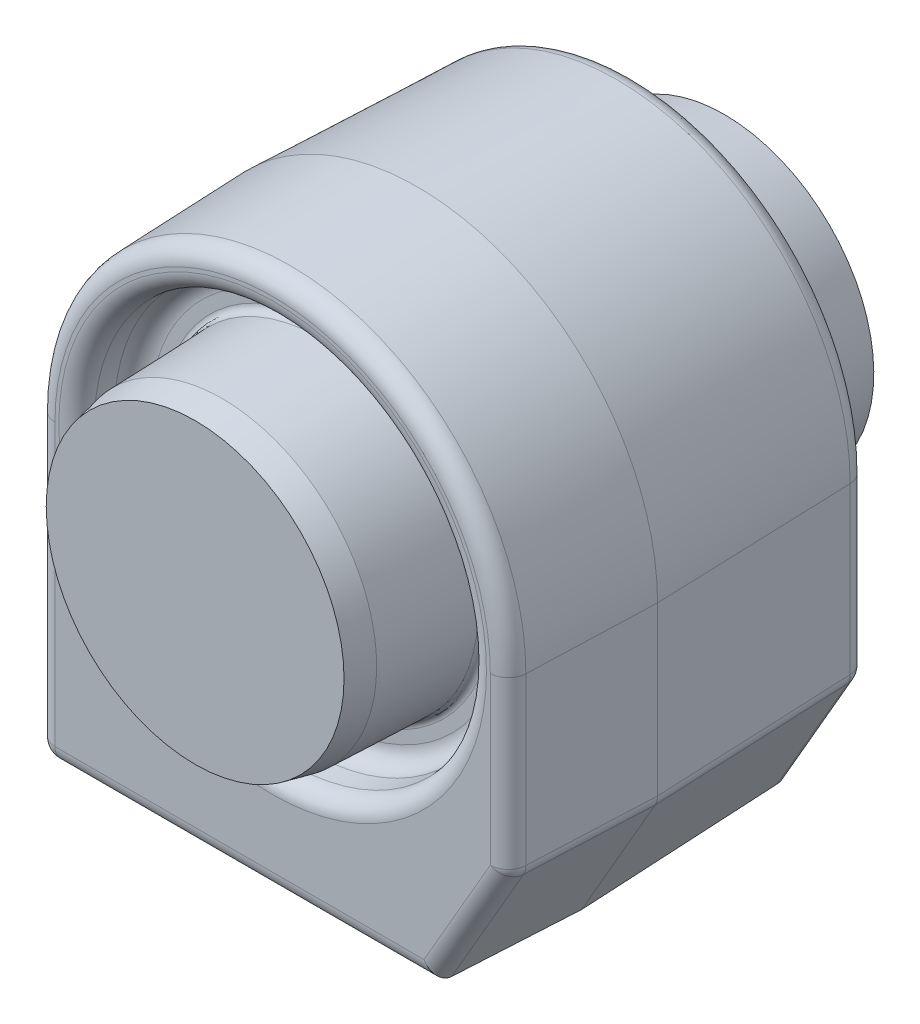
ISO-10303-21;
HEADER;
FILE_DESCRIPTION(('STEP AP214'),'2;1');
FILE_NAME('part.step','',(''),(''),'','','');
FILE_SCHEMA(('AUTOMOTIVE_DESIGN { 1 0 10303 214 1 1 1 1 }'));
ENDSEC;
DATA;
#1=APPLICATION_CONTEXT('core data for automotive mechanical design processes');
#2=APPLICATION_PROTOCOL_DEFINITION('international standard','automotive_design',2000,#1);
#3=PRODUCT_CONTEXT('',#1,'mechanical');
#4=PRODUCT('Part','Part','',(#3));
#5=PRODUCT_RELATED_PRODUCT_CATEGORY('part','',(#4));
#6=PRODUCT_DEFINITION_FORMATION('','',#4);
#7=PRODUCT_DEFINITION_CONTEXT('part definition',#1,'design');
#8=PRODUCT_DEFINITION('design','',#6,#7);
#9=PRODUCT_DEFINITION_SHAPE('','',#8);
#10=(LENGTH_UNIT() NAMED_UNIT(*) SI_UNIT(.MILLI.,.METRE.));
#11=(NAMED_UNIT(*) PLANE_ANGLE_UNIT() SI_UNIT($,.RADIAN.));
#12=(NAMED_UNIT(*) SI_UNIT($,.STERADIAN.) SOLID_ANGLE_UNIT());
#13=UNCERTAINTY_MEASURE_WITH_UNIT(LENGTH_MEASURE(1.E-05),#10,'distance_accuracy_value','');
#14=(GEOMETRIC_REPRESENTATION_CONTEXT(3) GLOBAL_UNCERTAINTY_ASSIGNED_CONTEXT((#13)) GLOBAL_UNIT_ASSIGNED_CONTEXT((#10,
#11,#12)) REPRESENTATION_CONTEXT('',''));
#15=CARTESIAN_POINT('',(0.,0.,0.));
#16=DIRECTION('',(0.,0.,1.));
#17=DIRECTION('',(1.,0.,0.));
#18=AXIS2_PLACEMENT_3D('',#15,#16,#17);
#19=CARTESIAN_POINT('',(0.,0.,109.090909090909));
#20=DIRECTION('',(0.,0.,-1.));
#21=DIRECTION('',(-1.,0.,0.));
#22=AXIS2_PLACEMENT_3D('',#19,#20,#21);
#23=PLANE('',#22);
#24=CARTESIAN_POINT('',(0.,0.,109.090909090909));
#25=DIRECTION('',(0.,0.,-1.));
#26=DIRECTION('',(-1.,0.,0.));
#27=AXIS2_PLACEMENT_3D('',#24,#25,#26);
#28=CIRCLE('',#27,86.3379751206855);
#29=CARTESIAN_POINT('',(-86.3379751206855,0.,109.090909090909));
#30=VERTEX_POINT('',#29);
#31=EDGE_CURVE('E196',#30,#30,#28,.T.);
#32=ORIENTED_EDGE('',*,*,#31,.F.);
#33=EDGE_LOOP('',(#32));
#34=FACE_BOUND('',#33,.T.);
#35=CARTESIAN_POINT('',(0.,0.,109.090909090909));
#36=DIRECTION('',(0.,0.,-1.));
#37=DIRECTION('',(-1.,0.,0.));
#38=AXIS2_PLACEMENT_3D('',#35,#36,#37);
#39=CIRCLE('',#38,86.34);
#40=CARTESIAN_POINT('',(-86.34,0.,109.090909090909));
#41=VERTEX_POINT('',#40);
#42=EDGE_CURVE('E311',#41,#41,#39,.T.);
#43=ORIENTED_EDGE('',*,*,#42,.T.);
#44=EDGE_LOOP('',(#43));
#45=FACE_BOUND('',#44,.T.);
#46=ADVANCED_FACE('F35',(#34,#45),#23,.T.);
#47=CARTESIAN_POINT('',(0.,0.,80.8080808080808));
#48=DIRECTION('',(0.,0.,-1.));
#49=DIRECTION('',(1.,0.,0.));
#50=AXIS2_PLACEMENT_3D('',#47,#48,#49);
#51=CONICAL_SURFACE('',#50,131.313131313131,0.0349065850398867);
#52=DIRECTION('',(-0.034899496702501,0.,0.999390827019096));
#53=VECTOR('',#52,1.);
#54=CARTESIAN_POINT('',(131.313131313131,0.,80.8080808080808));
#55=LINE('',#54,#53);
#56=CARTESIAN_POINT('',(134.135011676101,0.,0.));
#57=VERTEX_POINT('',#56);
#58=CARTESIAN_POINT('',(131.65355608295,0.,71.0595908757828));
#59=VERTEX_POINT('',#58);
#60=EDGE_CURVE('E167',#57,#59,#55,.T.);
#61=ORIENTED_EDGE('',*,*,#60,.F.);
#62=CARTESIAN_POINT('',(0.,0.,0.));
#63=DIRECTION('',(0.,0.,-1.));
#64=DIRECTION('',(-1.,0.,0.));
#65=AXIS2_PLACEMENT_3D('',#62,#63,#64);
#66=CIRCLE('',#65,134.135011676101);
#67=CARTESIAN_POINT('',(-134.135011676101,0.,0.));
#68=VERTEX_POINT('',#67);
#69=EDGE_CURVE('E182',#57,#68,#66,.F.);
#70=ORIENTED_EDGE('',*,*,#69,.T.);
#71=DIRECTION('',(0.034899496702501,0.,0.999390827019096));
#72=VECTOR('',#71,1.);
#73=CARTESIAN_POINT('',(-131.313131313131,0.,80.8080808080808));
#74=LINE('',#73,#72);
#75=CARTESIAN_POINT('',(-131.65355608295,0.,71.0595908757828));
#76=VERTEX_POINT('',#75);
#77=EDGE_CURVE('E166',#68,#76,#74,.T.);
#78=ORIENTED_EDGE('',*,*,#77,.T.);
#79=CARTESIAN_POINT('',(0.,0.,71.0595908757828));
#80=DIRECTION('',(0.,0.,-1.));
#81=DIRECTION('',(-1.,0.,0.));
#82=AXIS2_PLACEMENT_3D('',#79,#80,#81);
#83=CIRCLE('',#82,131.65355608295);
#84=EDGE_CURVE('E194',#59,#76,#83,.F.);
#85=ORIENTED_EDGE('',*,*,#84,.F.);
#86=EDGE_LOOP('',(#61,#70,#78,#85));
#87=FACE_BOUND('',#86,.T.);
#88=ADVANCED_FACE('F193',(#87),#51,.T.);
#89=CARTESIAN_POINT('',(-131.313131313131,-156.565656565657,80.8080808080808));
#90=DIRECTION('',(0.999390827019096,0.,-0.034899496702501));
#91=DIRECTION('',(-0.034899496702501,0.,-0.999390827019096));
#92=AXIS2_PLACEMENT_3D('',#89,#90,#91);
#93=PLANE('',#92);
#94=DIRECTION('',(0.,-1.,0.));
#95=VECTOR('',#94,1.);
#96=CARTESIAN_POINT('',(-131.65355608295,-166.666666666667,71.0595908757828));
#97=LINE('',#96,#95);
#98=CARTESIAN_POINT('',(-131.65355608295,-156.912234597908,71.0595908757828));
#99=VERTEX_POINT('',#98);
#100=EDGE_CURVE('E288',#76,#99,#97,.T.);
#101=ORIENTED_EDGE('',*,*,#100,.F.);
#102=ORIENTED_EDGE('',*,*,#77,.F.);
#103=DIRECTION('',(0.,1.,0.));
#104=VECTOR('',#103,1.);
#105=CARTESIAN_POINT('',(-134.135011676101,-156.565656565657,0.));
#106=LINE('',#105,#104);
#107=CARTESIAN_POINT('',(-134.135011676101,-159.393690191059,0.));
#108=VERTEX_POINT('',#107);
#109=EDGE_CURVE('E191',#68,#108,#106,.F.);
#110=ORIENTED_EDGE('',*,*,#109,.T.);
#111=DIRECTION('',(-0.0348782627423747,-0.0348782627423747,-0.998782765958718));
#112=VECTOR('',#111,1.);
#113=CARTESIAN_POINT('',(-134.14729200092,-159.405970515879,-0.351662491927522));
#114=LINE('',#113,#112);
#115=EDGE_CURVE('E290',#99,#108,#114,.T.);
#116=ORIENTED_EDGE('',*,*,#115,.F.);
#117=EDGE_LOOP('',(#101,#102,#110,#116));
#118=FACE_BOUND('',#117,.T.);
#119=ADVANCED_FACE('F352',(#118),#93,.F.);
#120=CARTESIAN_POINT('',(90.1277750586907,-166.666666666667,80.8080808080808));
#121=DIRECTION('',(0.,0.999390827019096,-0.034899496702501));
#122=DIRECTION('',(0.,0.034899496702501,0.999390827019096));
#123=AXIS2_PLACEMENT_3D('',#120,#121,#122);
#124=PLANE('',#123);
#125=DIRECTION('',(-0.0348782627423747,-0.0348782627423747,-0.998782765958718));
#126=VECTOR('',#125,1.);
#127=CARTESIAN_POINT('',(-121.230554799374,-166.678946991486,80.4564183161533));
#128=LINE('',#127,#126);
#129=CARTESIAN_POINT('',(-124.040154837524,-169.488547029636,0.));
#130=VERTEX_POINT('',#129);
#131=CARTESIAN_POINT('',(-121.558699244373,-167.007091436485,71.0595908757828));
#132=VERTEX_POINT('',#131);
#133=EDGE_CURVE('E284',#130,#132,#128,.F.);
#134=ORIENTED_EDGE('',*,*,#133,.F.);
#135=DIRECTION('',(-1.,0.,0.));
#136=VECTOR('',#135,1.);
#137=CARTESIAN_POINT('',(90.1277750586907,-169.488547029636,0.));
#138=LINE('',#137,#136);
#139=CARTESIAN_POINT('',(91.7569884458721,-169.488547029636,0.));
#140=VERTEX_POINT('',#139);
#141=EDGE_CURVE('E208',#130,#140,#138,.F.);
#142=ORIENTED_EDGE('',*,*,#141,.T.);
#143=DIRECTION('',(-0.0201451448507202,0.0348924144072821,0.999188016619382));
#144=VECTOR('',#143,1.);
#145=CARTESIAN_POINT('',(90.1277750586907,-166.666666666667,80.8080808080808));
#146=LINE('',#145,#144);
#147=CARTESIAN_POINT('',(90.3243193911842,-167.007091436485,71.0595908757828));
#148=VERTEX_POINT('',#147);
#149=EDGE_CURVE('E202',#140,#148,#146,.T.);
#150=ORIENTED_EDGE('',*,*,#149,.T.);
#151=DIRECTION('',(1.,0.,0.));
#152=VECTOR('',#151,1.);
#153=CARTESIAN_POINT('',(90.1277750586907,-167.007091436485,71.0595908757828));
#154=LINE('',#153,#152);
#155=EDGE_CURVE('E286',#132,#148,#154,.T.);
#156=ORIENTED_EDGE('',*,*,#155,.F.);
#157=EDGE_LOOP('',(#134,#142,#150,#156));
#158=FACE_BOUND('',#157,.T.);
#159=ADVANCED_FACE('F362',(#158),#124,.F.);
#160=CARTESIAN_POINT('',(100.333461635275,-148.989898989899,80.8080808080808));
#161=DIRECTION('',(-0.865497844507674,0.499695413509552,-0.034899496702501));
#162=DIRECTION('',(-0.500000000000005,-0.866025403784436,0.));
#163=AXIS2_PLACEMENT_3D('',#160,#161,#162);
#164=PLANE('',#163);
#165=DIRECTION('',(0.500000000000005,0.866025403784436,0.));
#166=VECTOR('',#165,1.);
#167=CARTESIAN_POINT('',(131.607947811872,-95.5017494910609,71.0595908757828));
#168=LINE('',#167,#166);
#169=CARTESIAN_POINT('',(130.301101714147,-97.7652733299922,71.0595908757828));
#170=VERTEX_POINT('',#169);
#171=EDGE_CURVE('E271',#148,#170,#168,.T.);
#172=ORIENTED_EDGE('',*,*,#171,.F.);
#173=ORIENTED_EDGE('',*,*,#149,.F.);
#174=DIRECTION('',(-0.500000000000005,-0.866025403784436,0.));
#175=VECTOR('',#174,1.);
#176=CARTESIAN_POINT('',(102.777281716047,-150.400839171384,0.));
#177=LINE('',#176,#175);
#178=CARTESIAN_POINT('',(132.782557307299,-98.4301773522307,0.));
#179=VERTEX_POINT('',#178);
#180=EDGE_CURVE('E178',#140,#179,#177,.F.);
#181=ORIENTED_EDGE('',*,*,#180,.T.);
#182=DIRECTION('',(0.0348979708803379,-0.00935088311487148,-0.999347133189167));
#183=VECTOR('',#182,1.);
#184=CARTESIAN_POINT('',(132.783439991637,-98.4304138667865,-0.0252767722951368));
#185=LINE('',#184,#183);
#186=EDGE_CURVE('E273',#170,#179,#185,.T.);
#187=ORIENTED_EDGE('',*,*,#186,.F.);
#188=EDGE_LOOP('',(#172,#173,#181,#187));
#189=FACE_BOUND('',#188,.T.);
#190=ADVANCED_FACE('F366',(#189),#164,.F.);
#191=CARTESIAN_POINT('',(131.313131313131,0.,80.8080808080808));
#192=DIRECTION('',(-0.999390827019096,0.,-0.034899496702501));
#193=DIRECTION('',(-0.034899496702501,0.,0.999390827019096));
#194=AXIS2_PLACEMENT_3D('',#191,#192,#193);
#195=PLANE('',#194);
#196=DIRECTION('',(0.0348979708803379,-0.00935088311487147,-0.999347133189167));
#197=VECTOR('',#196,1.);
#198=CARTESIAN_POINT('',(131.31401399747,-92.6268648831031,80.7828040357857));
#199=LINE('',#198,#197);
#200=CARTESIAN_POINT('',(134.135011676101,-93.3827489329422,0.));
#201=VERTEX_POINT('',#200);
#202=CARTESIAN_POINT('',(131.65355608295,-92.7178449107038,71.0595908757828));
#203=VERTEX_POINT('',#202);
#204=EDGE_CURVE('E175',#201,#203,#199,.F.);
#205=ORIENTED_EDGE('',*,*,#204,.F.);
#206=DIRECTION('',(0.,-1.,0.));
#207=VECTOR('',#206,1.);
#208=CARTESIAN_POINT('',(134.135011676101,0.,0.));
#209=LINE('',#208,#207);
#210=EDGE_CURVE('E158',#201,#57,#209,.F.);
#211=ORIENTED_EDGE('',*,*,#210,.T.);
#212=ORIENTED_EDGE('',*,*,#60,.T.);
#213=DIRECTION('',(0.,1.,0.));
#214=VECTOR('',#213,1.);
#215=CARTESIAN_POINT('',(131.65355608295,0.,71.0595908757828));
#216=LINE('',#215,#214);
#217=EDGE_CURVE('E258',#203,#59,#216,.T.);
#218=ORIENTED_EDGE('',*,*,#217,.F.);
#219=EDGE_LOOP('',(#205,#211,#212,#218));
#220=FACE_BOUND('',#219,.T.);
#221=ADVANCED_FACE('F171',(#220),#195,.F.);
#222=CARTESIAN_POINT('',(0.,0.,-90.9090909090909));
#223=DIRECTION('',(0.,0.,1.));
#224=DIRECTION('',(1.,0.,0.));
#225=AXIS2_PLACEMENT_3D('',#222,#223,#224);
#226=CONICAL_SURFACE('',#225,88.3838383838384,0.0349065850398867);
#227=CARTESIAN_POINT('',(0.,0.,-94.8084868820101));
#228=DIRECTION('',(0.,0.,1.));
#229=DIRECTION('',(1.,0.,0.));
#230=AXIS2_PLACEMENT_3D('',#227,#228,#229);
#231=CIRCLE('',#230,88.247668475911);
#232=CARTESIAN_POINT('',(88.247668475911,0.,-94.8084868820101));
#233=VERTEX_POINT('',#232);
#234=EDGE_CURVE('E299',#233,#233,#231,.T.);
#235=ORIENTED_EDGE('',*,*,#234,.F.);
#236=EDGE_LOOP('',(#235));
#237=FACE_BOUND('',#236,.T.);
#238=CARTESIAN_POINT('',(0.,0.,-141.414141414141));
#239=DIRECTION('',(0.,0.,1.));
#240=DIRECTION('',(1.,0.,0.));
#241=AXIS2_PLACEMENT_3D('',#238,#239,#240);
#242=CIRCLE('',#241,86.6201631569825);
#243=CARTESIAN_POINT('',(86.6201631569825,0.,-141.414141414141));
#244=VERTEX_POINT('',#243);
#245=EDGE_CURVE('E199',#244,#244,#242,.T.);
#246=ORIENTED_EDGE('',*,*,#245,.T.);
#247=EDGE_LOOP('',(#246));
#248=FACE_BOUND('',#247,.T.);
#249=ADVANCED_FACE('F372',(#237,#248),#226,.T.);
#250=CARTESIAN_POINT('',(0.,0.,50.5050505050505));
#251=DIRECTION('',(0.,0.,-1.));
#252=DIRECTION('',(-1.,0.,0.));
#253=AXIS2_PLACEMENT_3D('',#250,#251,#252);
#254=CONICAL_SURFACE('',#253,88.3838383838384,0.0349065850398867);
#255=CARTESIAN_POINT('',(0.,0.,54.4044464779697));
#256=DIRECTION('',(0.,0.,-1.));
#257=DIRECTION('',(-1.,0.,0.));
#258=AXIS2_PLACEMENT_3D('',#255,#256,#257);
#259=CIRCLE('',#258,88.247668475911);
#260=CARTESIAN_POINT('',(-88.247668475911,0.,54.4044464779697));
#261=VERTEX_POINT('',#260);
#262=EDGE_CURVE('E305',#261,#261,#259,.T.);
#263=ORIENTED_EDGE('',*,*,#262,.F.);
#264=EDGE_LOOP('',(#263));
#265=FACE_BOUND('',#264,.T.);
#266=ORIENTED_EDGE('',*,*,#31,.T.);
#267=EDGE_LOOP('',(#266));
#268=FACE_BOUND('',#267,.T.);
#269=ADVANCED_FACE('F392',(#265,#268),#254,.T.);
#270=CARTESIAN_POINT('',(0.,0.,-121.212121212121));
#271=DIRECTION('',(0.,0.,1.));
#272=DIRECTION('',(1.,0.,0.));
#273=AXIS2_PLACEMENT_3D('',#270,#271,#272);
#274=PLANE('',#273);
#275=DIRECTION('',(-0.500000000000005,-0.866025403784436,0.));
#276=VECTOR('',#275,1.);
#277=CARTESIAN_POINT('',(130.095118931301,-75.110451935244,-121.212121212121));
#278=LINE('',#277,#276);
#279=CARTESIAN_POINT('',(83.6814443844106,-155.501294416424,-121.212121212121));
#280=VERTEX_POINT('',#279);
#281=CARTESIAN_POINT('',(120.147759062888,-92.3397846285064,-121.212121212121));
#282=VERTEX_POINT('',#281);
#283=EDGE_CURVE('E249',#280,#282,#278,.F.);
#284=ORIENTED_EDGE('',*,*,#283,.F.);
#285=DIRECTION('',(-1.,0.,0.));
#286=VECTOR('',#285,1.);
#287=CARTESIAN_POINT('',(0.,-155.501294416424,-121.212121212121));
#288=LINE('',#287,#286);
#289=CARTESIAN_POINT('',(-120.147759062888,-155.501294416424,-121.212121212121));
#290=VERTEX_POINT('',#289);
#291=EDGE_CURVE('E247',#290,#280,#288,.F.);
#292=ORIENTED_EDGE('',*,*,#291,.F.);
#293=DIRECTION('',(0.,1.,0.));
#294=VECTOR('',#293,1.);
#295=CARTESIAN_POINT('',(-120.147759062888,0.,-121.212121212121));
#296=LINE('',#295,#294);
#297=CARTESIAN_POINT('',(-120.147759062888,0.,-121.212121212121));
#298=VERTEX_POINT('',#297);
#299=EDGE_CURVE('E245',#298,#290,#296,.F.);
#300=ORIENTED_EDGE('',*,*,#299,.F.);
#301=CARTESIAN_POINT('',(0.,0.,-121.212121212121));
#302=DIRECTION('',(0.,0.,1.));
#303=DIRECTION('',(1.,0.,0.));
#304=AXIS2_PLACEMENT_3D('',#301,#302,#303);
#305=CIRCLE('',#304,120.147759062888);
#306=CARTESIAN_POINT('',(120.147759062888,0.,-121.212121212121));
#307=VERTEX_POINT('',#306);
#308=EDGE_CURVE('E243',#307,#298,#305,.T.);
#309=ORIENTED_EDGE('',*,*,#308,.F.);
#310=DIRECTION('',(0.,-1.,0.));
#311=VECTOR('',#310,1.);
#312=CARTESIAN_POINT('',(120.147759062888,0.,-121.212121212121));
#313=LINE('',#312,#311);
#314=EDGE_CURVE('E251',#282,#307,#313,.F.);
#315=ORIENTED_EDGE('',*,*,#314,.F.);
#316=EDGE_LOOP('',(#284,#292,#300,#309,#315));
#317=FACE_BOUND('',#316,.T.);
#318=CARTESIAN_POINT('',(0.,0.,-121.212121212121));
#319=DIRECTION('',(0.,0.,1.));
#320=DIRECTION('',(1.,0.,0.));
#321=AXIS2_PLACEMENT_3D('',#318,#319,#320);
#322=CIRCLE('',#321,119.39849579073);
#323=CARTESIAN_POINT('',(119.39849579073,0.,-121.212121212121));
#324=VERTEX_POINT('',#323);
#325=EDGE_CURVE('E237',#324,#324,#322,.F.);
#326=ORIENTED_EDGE('',*,*,#325,.F.);
#327=EDGE_LOOP('',(#326));
#328=FACE_BOUND('',#327,.T.);
#329=ADVANCED_FACE('F358',(#317,#328),#274,.F.);
#330=CARTESIAN_POINT('',(0.,0.,80.8080808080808));
#331=DIRECTION('',(0.,0.,1.));
#332=DIRECTION('',(1.,0.,0.));
#333=AXIS2_PLACEMENT_3D('',#330,#331,#332);
#334=PLANE('',#333);
#335=CARTESIAN_POINT('',(0.,0.,80.8080808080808));
#336=DIRECTION('',(0.,0.,1.));
#337=DIRECTION('',(1.,0.,0.));
#338=AXIS2_PLACEMENT_3D('',#335,#336,#337);
#339=CIRCLE('',#338,121.558699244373);
#340=CARTESIAN_POINT('',(-121.558699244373,0.,80.8080808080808));
#341=VERTEX_POINT('',#340);
#342=CARTESIAN_POINT('',(121.558699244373,0.,80.8080808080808));
#343=VERTEX_POINT('',#342);
#344=EDGE_CURVE('E260',#341,#343,#339,.F.);
#345=ORIENTED_EDGE('',*,*,#344,.F.);
#346=DIRECTION('',(0.,1.,0.));
#347=VECTOR('',#346,1.);
#348=CARTESIAN_POINT('',(-121.558699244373,0.,80.8080808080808));
#349=LINE('',#348,#347);
#350=CARTESIAN_POINT('',(-121.558699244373,-156.912234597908,80.8080808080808));
#351=VERTEX_POINT('',#350);
#352=EDGE_CURVE('E262',#351,#341,#349,.T.);
#353=ORIENTED_EDGE('',*,*,#352,.F.);
#354=DIRECTION('',(-1.,0.,0.));
#355=VECTOR('',#354,1.);
#356=CARTESIAN_POINT('',(-131.313131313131,-156.912234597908,80.8080808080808));
#357=LINE('',#356,#355);
#358=CARTESIAN_POINT('',(84.4960510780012,-156.912234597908,80.8080808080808));
#359=VERTEX_POINT('',#358);
#360=EDGE_CURVE('E264',#359,#351,#357,.T.);
#361=ORIENTED_EDGE('',*,*,#360,.F.);
#362=DIRECTION('',(-0.500000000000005,-0.866025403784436,0.));
#363=VECTOR('',#362,1.);
#364=CARTESIAN_POINT('',(81.6801890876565,-161.789450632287,80.8080808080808));
#365=LINE('',#364,#363);
#366=CARTESIAN_POINT('',(121.558699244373,-92.7178449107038,80.8080808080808));
#367=VERTEX_POINT('',#366);
#368=EDGE_CURVE('E266',#367,#359,#365,.T.);
#369=ORIENTED_EDGE('',*,*,#368,.F.);
#370=DIRECTION('',(0.,-1.,0.));
#371=VECTOR('',#370,1.);
#372=CARTESIAN_POINT('',(121.558699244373,-95.3315371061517,80.8080808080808));
#373=LINE('',#372,#371);
#374=EDGE_CURVE('E268',#343,#367,#373,.T.);
#375=ORIENTED_EDGE('',*,*,#374,.F.);
#376=EDGE_LOOP('',(#345,#353,#361,#369,#375));
#377=FACE_BOUND('',#376,.T.);
#378=CARTESIAN_POINT('',(0.,0.,80.8080808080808));
#379=DIRECTION('',(0.,0.,1.));
#380=DIRECTION('',(1.,0.,0.));
#381=AXIS2_PLACEMENT_3D('',#378,#379,#380);
#382=CIRCLE('',#381,119.39849579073);
#383=CARTESIAN_POINT('',(119.39849579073,0.,80.8080808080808));
#384=VERTEX_POINT('',#383);
#385=EDGE_CURVE('E225',#384,#384,#382,.T.);
#386=ORIENTED_EDGE('',*,*,#385,.F.);
#387=EDGE_LOOP('',(#386));
#388=FACE_BOUND('',#387,.T.);
#389=ADVANCED_FACE('F390',(#377,#388),#334,.T.);
#390=CARTESIAN_POINT('',(90.1277750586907,-169.488547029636,0.));
#391=DIRECTION('',(0.,0.999390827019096,0.034899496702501));
#392=DIRECTION('',(0.,-0.0348994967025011,0.999390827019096));
#393=AXIS2_PLACEMENT_3D('',#390,#391,#392);
#394=PLANE('',#393);
#395=DIRECTION('',(0.0201451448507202,-0.0348924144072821,0.999188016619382));
#396=VECTOR('',#395,1.);
#397=CARTESIAN_POINT('',(91.7563272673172,-169.487401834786,-0.0327940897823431));
#398=LINE('',#397,#396);
#399=CARTESIAN_POINT('',(89.5097126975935,-165.596151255,-111.463631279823));
#400=VERTEX_POINT('',#399);
#401=EDGE_CURVE('E179',#400,#140,#398,.T.);
#402=ORIENTED_EDGE('',*,*,#401,.T.);
#403=ORIENTED_EDGE('',*,*,#141,.F.);
#404=DIRECTION('',(0.0348782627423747,0.0348782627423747,-0.998782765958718));
#405=VECTOR('',#404,1.);
#406=CARTESIAN_POINT('',(-124.052435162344,-169.500827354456,0.351662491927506));
#407=LINE('',#406,#405);
#408=CARTESIAN_POINT('',(-120.147759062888,-165.596151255,-111.463631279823));
#409=VERTEX_POINT('',#408);
#410=EDGE_CURVE('E280',#409,#130,#407,.F.);
#411=ORIENTED_EDGE('',*,*,#410,.F.);
#412=DIRECTION('',(1.,0.,0.));
#413=VECTOR('',#412,1.);
#414=CARTESIAN_POINT('',(90.1277750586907,-165.596151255,-111.463631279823));
#415=LINE('',#414,#413);
#416=EDGE_CURVE('E282',#400,#409,#415,.F.);
#417=ORIENTED_EDGE('',*,*,#416,.F.);
#418=EDGE_LOOP('',(#402,#403,#411,#417));
#419=FACE_BOUND('',#418,.T.);
#420=ADVANCED_FACE('F377',(#419),#394,.F.);
#421=CARTESIAN_POINT('',(-134.135011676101,-156.565656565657,0.));
#422=DIRECTION('',(0.999390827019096,0.,0.034899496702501));
#423=DIRECTION('',(0.0348994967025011,0.,-0.999390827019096));
#424=AXIS2_PLACEMENT_3D('',#421,#422,#423);
#425=PLANE('',#424);
#426=ORIENTED_EDGE('',*,*,#109,.F.);
#427=DIRECTION('',(0.034899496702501,0.,-0.999390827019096));
#428=VECTOR('',#427,1.);
#429=CARTESIAN_POINT('',(-134.135011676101,0.,0.));
#430=LINE('',#429,#428);
#431=CARTESIAN_POINT('',(-130.242615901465,0.,-111.463631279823));
#432=VERTEX_POINT('',#431);
#433=EDGE_CURVE('E185',#432,#68,#430,.F.);
#434=ORIENTED_EDGE('',*,*,#433,.F.);
#435=DIRECTION('',(0.,-1.,0.));
#436=VECTOR('',#435,1.);
#437=CARTESIAN_POINT('',(-130.242615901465,-156.565656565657,-111.463631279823));
#438=LINE('',#437,#436);
#439=CARTESIAN_POINT('',(-130.242615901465,-155.501294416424,-111.463631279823));
#440=VERTEX_POINT('',#439);
#441=EDGE_CURVE('E292',#440,#432,#438,.F.);
#442=ORIENTED_EDGE('',*,*,#441,.F.);
#443=DIRECTION('',(0.0348782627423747,0.0348782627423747,-0.998782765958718));
#444=VECTOR('',#443,1.);
#445=CARTESIAN_POINT('',(-129.914471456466,-155.173149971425,-120.860458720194));
#446=LINE('',#445,#444);
#447=EDGE_CURVE('E294',#108,#440,#446,.T.);
#448=ORIENTED_EDGE('',*,*,#447,.F.);
#449=EDGE_LOOP('',(#426,#434,#442,#448));
#450=FACE_BOUND('',#449,.T.);
#451=ADVANCED_FACE('F374',(#450),#425,.F.);
#452=CARTESIAN_POINT('',(0.,0.,0.));
#453=DIRECTION('',(0.,0.,1.));
#454=DIRECTION('',(-1.,0.,0.));
#455=AXIS2_PLACEMENT_3D('',#452,#453,#454);
#456=CONICAL_SURFACE('',#455,134.135011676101,0.0349065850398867);
#457=ORIENTED_EDGE('',*,*,#433,.T.);
#458=ORIENTED_EDGE('',*,*,#69,.F.);
#459=DIRECTION('',(-0.034899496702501,0.,-0.999390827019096));
#460=VECTOR('',#459,1.);
#461=CARTESIAN_POINT('',(134.135011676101,0.,0.));
#462=LINE('',#461,#460);
#463=CARTESIAN_POINT('',(130.242615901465,0.,-111.463631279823));
#464=VERTEX_POINT('',#463);
#465=EDGE_CURVE('E154',#464,#57,#462,.F.);
#466=ORIENTED_EDGE('',*,*,#465,.F.);
#467=CARTESIAN_POINT('',(0.,0.,-111.463631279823));
#468=DIRECTION('',(0.,0.,-1.));
#469=DIRECTION('',(-1.,0.,0.));
#470=AXIS2_PLACEMENT_3D('',#467,#468,#469);
#471=CIRCLE('',#470,130.242615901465);
#472=EDGE_CURVE('E296',#432,#464,#471,.T.);
#473=ORIENTED_EDGE('',*,*,#472,.F.);
#474=EDGE_LOOP('',(#457,#458,#466,#473));
#475=FACE_BOUND('',#474,.T.);
#476=ADVANCED_FACE('F183',(#475),#456,.T.);
#477=CARTESIAN_POINT('',(134.135011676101,0.,0.));
#478=DIRECTION('',(-0.999390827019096,0.,0.034899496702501));
#479=DIRECTION('',(0.0348994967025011,0.,0.999390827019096));
#480=AXIS2_PLACEMENT_3D('',#477,#478,#479);
#481=PLANE('',#480);
#482=ORIENTED_EDGE('',*,*,#465,.T.);
#483=ORIENTED_EDGE('',*,*,#210,.F.);
#484=DIRECTION('',(-0.0348979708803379,0.00935088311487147,-0.999347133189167));
#485=VECTOR('',#484,1.);
#486=CARTESIAN_POINT('',(134.13589436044,-93.3829854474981,0.0252767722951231));
#487=LINE('',#486,#485);
#488=CARTESIAN_POINT('',(130.242615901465,-92.3397846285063,-111.463631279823));
#489=VERTEX_POINT('',#488);
#490=EDGE_CURVE('E254',#489,#201,#487,.F.);
#491=ORIENTED_EDGE('',*,*,#490,.F.);
#492=DIRECTION('',(0.,1.,0.));
#493=VECTOR('',#492,1.);
#494=CARTESIAN_POINT('',(130.242615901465,0.,-111.463631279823));
#495=LINE('',#494,#493);
#496=EDGE_CURVE('E161',#464,#489,#495,.F.);
#497=ORIENTED_EDGE('',*,*,#496,.F.);
#498=EDGE_LOOP('',(#482,#483,#491,#497));
#499=FACE_BOUND('',#498,.T.);
#500=ADVANCED_FACE('F156',(#499),#481,.F.);
#501=CARTESIAN_POINT('',(102.777281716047,-150.400839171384,0.));
#502=DIRECTION('',(-0.865497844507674,0.499695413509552,0.034899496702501));
#503=DIRECTION('',(-0.500000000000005,-0.866025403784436,0.));
#504=AXIS2_PLACEMENT_3D('',#501,#502,#503);
#505=PLANE('',#504);
#506=ORIENTED_EDGE('',*,*,#180,.F.);
#507=ORIENTED_EDGE('',*,*,#401,.F.);
#508=DIRECTION('',(0.500000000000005,0.866025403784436,0.));
#509=VECTOR('',#508,1.);
#510=CARTESIAN_POINT('',(99.4063680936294,-148.454641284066,-111.463631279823));
#511=LINE('',#510,#509);
#512=CARTESIAN_POINT('',(128.890161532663,-97.3872130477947,-111.463631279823));
#513=VERTEX_POINT('',#512);
#514=EDGE_CURVE('E276',#513,#400,#511,.F.);
#515=ORIENTED_EDGE('',*,*,#514,.F.);
#516=DIRECTION('',(-0.0348979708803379,0.00935088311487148,-0.999347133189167));
#517=VECTOR('',#516,1.);
#518=CARTESIAN_POINT('',(128.550619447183,-97.2962330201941,-121.186844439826));
#519=LINE('',#518,#517);
#520=EDGE_CURVE('E278',#179,#513,#519,.T.);
#521=ORIENTED_EDGE('',*,*,#520,.F.);
#522=EDGE_LOOP('',(#506,#507,#515,#521));
#523=FACE_BOUND('',#522,.T.);
#524=ADVANCED_FACE('F383',(#523),#505,.F.);
#525=CARTESIAN_POINT('',(0.,0.,50.5050505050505));
#526=DIRECTION('',(0.,0.,1.));
#527=DIRECTION('',(-1.,0.,0.));
#528=AXIS2_PLACEMENT_3D('',#525,#526,#527);
#529=CONICAL_SURFACE('',#528,108.585858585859,0.0349065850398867);
#530=CARTESIAN_POINT('',(0.,0.,71.0595908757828));
#531=DIRECTION('',(0.,0.,1.));
#532=DIRECTION('',(1.,0.,0.));
#533=AXIS2_PLACEMENT_3D('',#530,#531,#532);
#534=CIRCLE('',#533,109.303638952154);
#535=CARTESIAN_POINT('',(109.303638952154,0.,71.0595908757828));
#536=VERTEX_POINT('',#535);
#537=EDGE_CURVE('E222',#536,#536,#534,.F.);
#538=ORIENTED_EDGE('',*,*,#537,.F.);
#539=EDGE_LOOP('',(#538));
#540=FACE_BOUND('',#539,.T.);
#541=CARTESIAN_POINT('',(0.,0.,60.2535404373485));
#542=DIRECTION('',(0.,0.,1.));
#543=DIRECTION('',(1.,0.,0.));
#544=AXIS2_PLACEMENT_3D('',#541,#542,#543);
#545=CIRCLE('',#544,108.926283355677);
#546=CARTESIAN_POINT('',(108.926283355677,0.,60.2535404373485));
#547=VERTEX_POINT('',#546);
#548=EDGE_CURVE('E190',#547,#547,#545,.T.);
#549=ORIENTED_EDGE('',*,*,#548,.F.);
#550=EDGE_LOOP('',(#549));
#551=FACE_BOUND('',#550,.T.);
#552=ADVANCED_FACE('F386',(#540,#551),#529,.F.);
#553=CARTESIAN_POINT('',(0.,0.,50.5050505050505));
#554=DIRECTION('',(0.,0.,-1.));
#555=DIRECTION('',(-1.,0.,0.));
#556=AXIS2_PLACEMENT_3D('',#553,#554,#555);
#557=PLANE('',#556);
#558=CARTESIAN_POINT('',(0.,0.,50.5050505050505));
#559=DIRECTION('',(0.,0.,-1.));
#560=DIRECTION('',(-1.,0.,0.));
#561=AXIS2_PLACEMENT_3D('',#558,#559,#560);
#562=CIRCLE('',#561,92.2856112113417);
#563=CARTESIAN_POINT('',(-92.2856112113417,0.,50.5050505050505));
#564=VERTEX_POINT('',#563);
#565=EDGE_CURVE('E308',#564,#564,#562,.F.);
#566=ORIENTED_EDGE('',*,*,#565,.F.);
#567=EDGE_LOOP('',(#566));
#568=FACE_BOUND('',#567,.T.);
#569=CARTESIAN_POINT('',(0.,0.,50.5050505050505));
#570=DIRECTION('',(0.,0.,-1.));
#571=DIRECTION('',(-1.,0.,0.));
#572=AXIS2_PLACEMENT_3D('',#569,#570,#571);
#573=CIRCLE('',#572,98.8314265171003);
#574=CARTESIAN_POINT('',(-98.8314265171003,0.,50.5050505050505));
#575=VERTEX_POINT('',#574);
#576=EDGE_CURVE('E228',#575,#575,#573,.T.);
#577=ORIENTED_EDGE('',*,*,#576,.F.);
#578=EDGE_LOOP('',(#577));
#579=FACE_BOUND('',#578,.T.);
#580=ADVANCED_FACE('F397',(#568,#579),#557,.F.);
#581=CARTESIAN_POINT('',(0.,0.,-90.9090909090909));
#582=DIRECTION('',(0.,0.,-1.));
#583=DIRECTION('',(1.,0.,0.));
#584=AXIS2_PLACEMENT_3D('',#581,#582,#583);
#585=CONICAL_SURFACE('',#584,108.585858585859,0.0349065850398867);
#586=CARTESIAN_POINT('',(0.,0.,-111.463631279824));
#587=DIRECTION('',(0.,0.,1.));
#588=DIRECTION('',(1.,0.,0.));
#589=AXIS2_PLACEMENT_3D('',#586,#587,#588);
#590=CIRCLE('',#589,109.303638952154);
#591=CARTESIAN_POINT('',(109.303638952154,0.,-111.463631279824));
#592=VERTEX_POINT('',#591);
#593=EDGE_CURVE('E234',#592,#592,#590,.T.);
#594=ORIENTED_EDGE('',*,*,#593,.F.);
#595=EDGE_LOOP('',(#594));
#596=FACE_BOUND('',#595,.T.);
#597=CARTESIAN_POINT('',(0.,0.,-100.657580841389));
#598=DIRECTION('',(0.,0.,-1.));
#599=DIRECTION('',(-1.,0.,0.));
#600=AXIS2_PLACEMENT_3D('',#597,#598,#599);
#601=CIRCLE('',#600,108.926283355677);
#602=CARTESIAN_POINT('',(-108.926283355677,0.,-100.657580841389));
#603=VERTEX_POINT('',#602);
#604=EDGE_CURVE('E231',#603,#603,#601,.T.);
#605=ORIENTED_EDGE('',*,*,#604,.F.);
#606=EDGE_LOOP('',(#605));
#607=FACE_BOUND('',#606,.T.);
#608=ADVANCED_FACE('F337',(#596,#607),#585,.F.);
#609=CARTESIAN_POINT('',(0.,0.,-90.9090909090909));
#610=DIRECTION('',(0.,0.,1.));
#611=DIRECTION('',(1.,0.,0.));
#612=AXIS2_PLACEMENT_3D('',#609,#610,#611);
#613=PLANE('',#612);
#614=CARTESIAN_POINT('',(0.,0.,-90.9090909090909));
#615=DIRECTION('',(0.,0.,1.));
#616=DIRECTION('',(1.,0.,0.));
#617=AXIS2_PLACEMENT_3D('',#614,#615,#616);
#618=CIRCLE('',#617,92.2856112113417);
#619=CARTESIAN_POINT('',(92.2856112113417,0.,-90.9090909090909));
#620=VERTEX_POINT('',#619);
#621=EDGE_CURVE('E302',#620,#620,#618,.F.);
#622=ORIENTED_EDGE('',*,*,#621,.F.);
#623=EDGE_LOOP('',(#622));
#624=FACE_BOUND('',#623,.T.);
#625=CARTESIAN_POINT('',(0.,0.,-90.9090909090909));
#626=DIRECTION('',(0.,0.,1.));
#627=DIRECTION('',(1.,0.,0.));
#628=AXIS2_PLACEMENT_3D('',#625,#626,#627);
#629=CIRCLE('',#628,98.8314265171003);
#630=CARTESIAN_POINT('',(98.8314265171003,0.,-90.9090909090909));
#631=VERTEX_POINT('',#630);
#632=EDGE_CURVE('E240',#631,#631,#629,.T.);
#633=ORIENTED_EDGE('',*,*,#632,.F.);
#634=EDGE_LOOP('',(#633));
#635=FACE_BOUND('',#634,.T.);
#636=ADVANCED_FACE('F529',(#624,#635),#613,.F.);
#637=CARTESIAN_POINT('',(0.,0.,70.7070707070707));
#638=DIRECTION('',(0.,0.,1.));
#639=DIRECTION('',(1.,0.,0.));
#640=AXIS2_PLACEMENT_3D('',#637,#638,#639);
#641=TOROIDAL_SURFACE('',#640,119.39849579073,10.1010101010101);
#642=ORIENTED_EDGE('',*,*,#385,.T.);
#643=EDGE_LOOP('',(#642));
#644=FACE_BOUND('',#643,.T.);
#645=ORIENTED_EDGE('',*,*,#537,.T.);
#646=EDGE_LOOP('',(#645));
#647=FACE_BOUND('',#646,.T.);
#648=ADVANCED_FACE('F525',(#644,#647),#641,.T.);
#649=CARTESIAN_POINT('',(0.,0.,60.6060606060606));
#650=DIRECTION('',(0.,0.,-1.));
#651=DIRECTION('',(-1.,0.,0.));
#652=AXIS2_PLACEMENT_3D('',#649,#650,#651);
#653=TOROIDAL_SURFACE('',#652,98.8314265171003,10.1010101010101);
#654=ORIENTED_EDGE('',*,*,#548,.T.);
#655=EDGE_LOOP('',(#654));
#656=FACE_BOUND('',#655,.T.);
#657=ORIENTED_EDGE('',*,*,#576,.T.);
#658=EDGE_LOOP('',(#657));
#659=FACE_BOUND('',#658,.T.);
#660=ADVANCED_FACE('F521',(#656,#659),#653,.F.);
#661=CARTESIAN_POINT('',(0.,0.,-111.111111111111));
#662=DIRECTION('',(0.,0.,1.));
#663=DIRECTION('',(1.,0.,0.));
#664=AXIS2_PLACEMENT_3D('',#661,#662,#663);
#665=TOROIDAL_SURFACE('',#664,119.39849579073,10.1010101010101);
#666=ORIENTED_EDGE('',*,*,#325,.T.);
#667=EDGE_LOOP('',(#666));
#668=FACE_BOUND('',#667,.T.);
#669=ORIENTED_EDGE('',*,*,#593,.T.);
#670=EDGE_LOOP('',(#669));
#671=FACE_BOUND('',#670,.T.);
#672=ADVANCED_FACE('F517',(#668,#671),#665,.T.);
#673=CARTESIAN_POINT('',(0.,0.,-101.010101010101));
#674=DIRECTION('',(0.,0.,1.));
#675=DIRECTION('',(1.,0.,0.));
#676=AXIS2_PLACEMENT_3D('',#673,#674,#675);
#677=TOROIDAL_SURFACE('',#676,98.8314265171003,10.1010101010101);
#678=ORIENTED_EDGE('',*,*,#604,.T.);
#679=EDGE_LOOP('',(#678));
#680=FACE_BOUND('',#679,.T.);
#681=ORIENTED_EDGE('',*,*,#632,.T.);
#682=EDGE_LOOP('',(#681));
#683=FACE_BOUND('',#682,.T.);
#684=ADVANCED_FACE('F513',(#680,#683),#677,.F.);
#685=CARTESIAN_POINT('',(-121.558699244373,-156.565656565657,70.7070707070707));
#686=DIRECTION('',(0.,-1.,0.));
#687=DIRECTION('',(1.,0.,0.));
#688=AXIS2_PLACEMENT_3D('',#685,#686,#687);
#689=CYLINDRICAL_SURFACE('',#688,10.1010101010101);
#690=CARTESIAN_POINT('',(-121.558699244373,-156.912234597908,70.7070707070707));
#691=DIRECTION('',(0.,1.,0.));
#692=DIRECTION('',(0.,0.,1.));
#693=AXIS2_PLACEMENT_3D('',#690,#691,#692);
#694=CIRCLE('',#693,10.1010101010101);
#695=EDGE_CURVE('E562',#99,#351,#694,.T.);
#696=ORIENTED_EDGE('',*,*,#695,.T.);
#697=ORIENTED_EDGE('',*,*,#352,.T.);
#698=CARTESIAN_POINT('',(-121.558699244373,0.,70.7070707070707));
#699=DIRECTION('',(0.,-1.,0.));
#700=DIRECTION('',(1.,0.,0.));
#701=AXIS2_PLACEMENT_3D('',#698,#699,#700);
#702=CIRCLE('',#701,10.1010101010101);
#703=EDGE_CURVE('E219',#341,#76,#702,.T.);
#704=ORIENTED_EDGE('',*,*,#703,.T.);
#705=ORIENTED_EDGE('',*,*,#100,.T.);
#706=EDGE_LOOP('',(#696,#697,#704,#705));
#707=FACE_BOUND('',#706,.T.);
#708=ADVANCED_FACE('F509',(#707),#689,.T.);
#709=CARTESIAN_POINT('',(0.,0.,70.7070707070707));
#710=DIRECTION('',(0.,0.,1.));
#711=DIRECTION('',(1.,0.,0.));
#712=AXIS2_PLACEMENT_3D('',#709,#710,#711);
#713=TOROIDAL_SURFACE('',#712,121.558699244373,10.1010101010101);
#714=ORIENTED_EDGE('',*,*,#703,.F.);
#715=ORIENTED_EDGE('',*,*,#344,.T.);
#716=CARTESIAN_POINT('',(121.558699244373,0.,70.7070707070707));
#717=DIRECTION('',(0.,1.,0.));
#718=DIRECTION('',(0.,0.,1.));
#719=AXIS2_PLACEMENT_3D('',#716,#717,#718);
#720=CIRCLE('',#719,10.1010101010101);
#721=EDGE_CURVE('E559',#343,#59,#720,.T.);
#722=ORIENTED_EDGE('',*,*,#721,.T.);
#723=ORIENTED_EDGE('',*,*,#84,.T.);
#724=EDGE_LOOP('',(#714,#715,#722,#723));
#725=FACE_BOUND('',#724,.T.);
#726=ADVANCED_FACE('F505',(#725),#713,.T.);
#727=CARTESIAN_POINT('',(90.1277750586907,-156.912234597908,70.7070707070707));
#728=DIRECTION('',(1.,0.,0.));
#729=DIRECTION('',(0.,0.,-1.));
#730=AXIS2_PLACEMENT_3D('',#727,#728,#729);
#731=CYLINDRICAL_SURFACE('',#730,10.1010101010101);
#732=CARTESIAN_POINT('',(-121.558699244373,-156.912234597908,70.7070707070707));
#733=DIRECTION('',(1.,0.,0.));
#734=DIRECTION('',(0.,1.,0.));
#735=AXIS2_PLACEMENT_3D('',#732,#733,#734);
#736=CIRCLE('',#735,10.1010101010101);
#737=EDGE_CURVE('E566',#351,#132,#736,.T.);
#738=ORIENTED_EDGE('',*,*,#737,.T.);
#739=ORIENTED_EDGE('',*,*,#155,.T.);
#740=CARTESIAN_POINT('',(84.4960510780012,-156.912234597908,70.7070707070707));
#741=DIRECTION('',(0.86602540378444,0.499999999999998,0.));
#742=DIRECTION('',(-0.499999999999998,0.86602540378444,0.));
#743=AXIS2_PLACEMENT_3D('',#740,#741,#742);
#744=ELLIPSE('',#743,11.6636418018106,10.1010101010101);
#745=EDGE_CURVE('E563',#148,#359,#744,.F.);
#746=ORIENTED_EDGE('',*,*,#745,.T.);
#747=ORIENTED_EDGE('',*,*,#360,.T.);
#748=EDGE_LOOP('',(#738,#739,#746,#747));
#749=FACE_BOUND('',#748,.T.);
#750=ADVANCED_FACE('F501',(#749),#731,.T.);
#751=CARTESIAN_POINT('',(-121.558699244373,-156.912234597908,70.7070707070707));
#752=DIRECTION('',(0.,0.,1.));
#753=DIRECTION('',(1.,0.,0.));
#754=AXIS2_PLACEMENT_3D('',#751,#752,#753);
#755=SPHERICAL_SURFACE('',#754,10.1010101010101);
#756=ORIENTED_EDGE('',*,*,#695,.F.);
#757=CARTESIAN_POINT('',(-121.558699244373,-156.912234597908,70.7070707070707));
#758=DIRECTION('',(-0.0348782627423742,-0.0348782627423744,-0.998782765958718));
#759=DIRECTION('',(0.,0.999390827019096,-0.0348994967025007));
#760=AXIS2_PLACEMENT_3D('',#757,#758,#759);
#761=CIRCLE('',#760,10.1010101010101);
#762=EDGE_CURVE('E569',#99,#132,#761,.F.);
#763=ORIENTED_EDGE('',*,*,#762,.T.);
#764=ORIENTED_EDGE('',*,*,#737,.F.);
#765=EDGE_LOOP('',(#756,#763,#764));
#766=FACE_BOUND('',#765,.T.);
#767=ADVANCED_FACE('F497',(#766),#755,.T.);
#768=CARTESIAN_POINT('',(121.558699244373,0.,70.7070707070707));
#769=DIRECTION('',(0.,1.,0.));
#770=DIRECTION('',(0.,0.,1.));
#771=AXIS2_PLACEMENT_3D('',#768,#769,#770);
#772=CYLINDRICAL_SURFACE('',#771,10.1010101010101);
#773=ORIENTED_EDGE('',*,*,#721,.F.);
#774=ORIENTED_EDGE('',*,*,#374,.T.);
#775=CARTESIAN_POINT('',(121.558699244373,-92.7178449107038,70.7070707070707));
#776=DIRECTION('',(0.,1.,0.));
#777=DIRECTION('',(0.,0.,1.));
#778=AXIS2_PLACEMENT_3D('',#775,#776,#777);
#779=CIRCLE('',#778,10.1010101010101);
#780=EDGE_CURVE('E584',#367,#203,#779,.T.);
#781=ORIENTED_EDGE('',*,*,#780,.T.);
#782=ORIENTED_EDGE('',*,*,#217,.T.);
#783=EDGE_LOOP('',(#773,#774,#781,#782));
#784=FACE_BOUND('',#783,.T.);
#785=ADVANCED_FACE('F493',(#784),#772,.T.);
#786=CARTESIAN_POINT('',(91.8858756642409,-144.11268295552,70.7070707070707));
#787=DIRECTION('',(0.500000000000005,0.866025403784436,0.));
#788=DIRECTION('',(-0.866025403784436,0.500000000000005,0.));
#789=AXIS2_PLACEMENT_3D('',#786,#787,#788);
#790=CYLINDRICAL_SURFACE('',#789,10.1010101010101);
#791=ORIENTED_EDGE('',*,*,#745,.F.);
#792=ORIENTED_EDGE('',*,*,#171,.T.);
#793=CARTESIAN_POINT('',(121.558699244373,-92.7178449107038,70.7070707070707));
#794=DIRECTION('',(-0.500000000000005,-0.866025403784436,0.));
#795=DIRECTION('',(0.866025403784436,-0.500000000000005,0.));
#796=AXIS2_PLACEMENT_3D('',#793,#794,#795);
#797=CIRCLE('',#796,10.1010101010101);
#798=EDGE_CURVE('E585',#170,#367,#797,.T.);
#799=ORIENTED_EDGE('',*,*,#798,.T.);
#800=ORIENTED_EDGE('',*,*,#368,.T.);
#801=EDGE_LOOP('',(#791,#792,#799,#800));
#802=FACE_BOUND('',#801,.T.);
#803=ADVANCED_FACE('F489',(#802),#790,.T.);
#804=CARTESIAN_POINT('',(-120.96117343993,-156.314708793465,87.8179709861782));
#805=DIRECTION('',(-0.0348782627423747,-0.0348782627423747,-0.998782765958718));
#806=DIRECTION('',(0.,0.999390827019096,-0.034899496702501));
#807=AXIS2_PLACEMENT_3D('',#804,#805,#806);
#808=CYLINDRICAL_SURFACE('',#807,10.1010101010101);
#809=ORIENTED_EDGE('',*,*,#762,.F.);
#810=ORIENTED_EDGE('',*,*,#115,.T.);
#811=CARTESIAN_POINT('',(-124.027844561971,-159.381379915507,1.94937360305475E-13));
#812=DIRECTION('',(0.,0.,-1.));
#813=DIRECTION('',(-0.707106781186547,-0.707106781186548,0.));
#814=AXIS2_PLACEMENT_3D('',#811,#812,#813);
#815=ELLIPSE('',#814,10.1133203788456,10.1010101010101);
#816=EDGE_CURVE('E589',#108,#130,#815,.F.);
#817=ORIENTED_EDGE('',*,*,#816,.T.);
#818=ORIENTED_EDGE('',*,*,#133,.T.);
#819=EDGE_LOOP('',(#809,#810,#817,#818));
#820=FACE_BOUND('',#819,.T.);
#821=ADVANCED_FACE('F485',(#820),#808,.T.);
#822=CARTESIAN_POINT('',(121.558699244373,-92.7178449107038,70.7070707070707));
#823=DIRECTION('',(0.,0.,1.));
#824=DIRECTION('',(1.,0.,0.));
#825=AXIS2_PLACEMENT_3D('',#822,#823,#824);
#826=SPHERICAL_SURFACE('',#825,10.1010101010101);
#827=ORIENTED_EDGE('',*,*,#798,.F.);
#828=CARTESIAN_POINT('',(121.558699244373,-92.7178449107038,70.7070707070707));
#829=DIRECTION('',(0.0348979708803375,-0.00935088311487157,-0.999347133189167));
#830=DIRECTION('',(-0.999390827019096,0.,-0.0348994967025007));
#831=AXIS2_PLACEMENT_3D('',#828,#829,#830);
#832=CIRCLE('',#831,10.1010101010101);
#833=EDGE_CURVE('E591',#170,#203,#832,.F.);
#834=ORIENTED_EDGE('',*,*,#833,.T.);
#835=ORIENTED_EDGE('',*,*,#780,.F.);
#836=EDGE_LOOP('',(#827,#834,#835));
#837=FACE_BOUND('',#836,.T.);
#838=ADVANCED_FACE('F481',(#837),#826,.T.);
#839=CARTESIAN_POINT('',(-123.779621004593,-159.133156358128,-7.10819265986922));
#840=DIRECTION('',(0.0348782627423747,0.0348782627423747,-0.998782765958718));
#841=DIRECTION('',(0.,0.999390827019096,0.034899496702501));
#842=AXIS2_PLACEMENT_3D('',#839,#840,#841);
#843=CYLINDRICAL_SURFACE('',#842,10.1010101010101);
#844=ORIENTED_EDGE('',*,*,#816,.F.);
#845=ORIENTED_EDGE('',*,*,#447,.T.);
#846=CARTESIAN_POINT('',(-120.147759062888,-155.501294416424,-111.111111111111));
#847=DIRECTION('',(-0.0348782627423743,-0.0348782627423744,0.998782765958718));
#848=DIRECTION('',(0.,-0.999390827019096,-0.0348994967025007));
#849=AXIS2_PLACEMENT_3D('',#846,#847,#848);
#850=CIRCLE('',#849,10.1010101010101);
#851=EDGE_CURVE('E597',#440,#409,#850,.T.);
#852=ORIENTED_EDGE('',*,*,#851,.T.);
#853=ORIENTED_EDGE('',*,*,#410,.T.);
#854=EDGE_LOOP('',(#844,#845,#852,#853));
#855=FACE_BOUND('',#854,.T.);
#856=ADVANCED_FACE('F477',(#855),#843,.T.);
#857=CARTESIAN_POINT('',(121.188047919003,-92.6185291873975,81.321135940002));
#858=DIRECTION('',(0.0348979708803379,-0.00935088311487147,-0.999347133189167));
#859=DIRECTION('',(-0.999390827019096,0.,-0.034899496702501));
#860=AXIS2_PLACEMENT_3D('',#857,#858,#859);
#861=CYLINDRICAL_SURFACE('',#860,10.1010101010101);
#862=ORIENTED_EDGE('',*,*,#833,.F.);
#863=ORIENTED_EDGE('',*,*,#186,.T.);
#864=CARTESIAN_POINT('',(124.027844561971,-93.3794504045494,2.49191275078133E-12));
#865=DIRECTION('',(0.,0.,-1.));
#866=DIRECTION('',(0.965925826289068,-0.258819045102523,0.));
#867=AXIS2_PLACEMENT_3D('',#864,#865,#866);
#868=ELLIPSE('',#867,10.1076090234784,10.1010101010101);
#869=EDGE_CURVE('E600',#179,#201,#868,.F.);
#870=ORIENTED_EDGE('',*,*,#869,.T.);
#871=ORIENTED_EDGE('',*,*,#204,.T.);
#872=EDGE_LOOP('',(#862,#863,#870,#871));
#873=FACE_BOUND('',#872,.T.);
#874=ADVANCED_FACE('F473',(#873),#861,.T.);
#875=CARTESIAN_POINT('',(0.,-155.501294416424,-111.111111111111));
#876=DIRECTION('',(-1.,0.,0.));
#877=DIRECTION('',(0.,0.,1.));
#878=AXIS2_PLACEMENT_3D('',#875,#876,#877);
#879=CYLINDRICAL_SURFACE('',#878,10.1010101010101);
#880=CARTESIAN_POINT('',(-120.147759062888,-155.501294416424,-111.111111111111));
#881=DIRECTION('',(1.,0.,0.));
#882=DIRECTION('',(0.,0.,-1.));
#883=AXIS2_PLACEMENT_3D('',#880,#881,#882);
#884=CIRCLE('',#883,10.1010101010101);
#885=EDGE_CURVE('E594',#409,#290,#884,.T.);
#886=ORIENTED_EDGE('',*,*,#885,.T.);
#887=ORIENTED_EDGE('',*,*,#291,.T.);
#888=CARTESIAN_POINT('',(83.6814443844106,-155.501294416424,-111.111111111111));
#889=DIRECTION('',(-0.86602540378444,-0.499999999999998,0.));
#890=DIRECTION('',(0.499999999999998,-0.86602540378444,0.));
#891=AXIS2_PLACEMENT_3D('',#888,#889,#890);
#892=ELLIPSE('',#891,11.6636418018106,10.1010101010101);
#893=EDGE_CURVE('E602',#280,#400,#892,.T.);
#894=ORIENTED_EDGE('',*,*,#893,.T.);
#895=ORIENTED_EDGE('',*,*,#416,.T.);
#896=EDGE_LOOP('',(#886,#887,#894,#895));
#897=FACE_BOUND('',#896,.T.);
#898=ADVANCED_FACE('F469',(#897),#879,.T.);
#899=CARTESIAN_POINT('',(-120.147759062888,-155.501294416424,-111.111111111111));
#900=DIRECTION('',(0.,0.,1.));
#901=DIRECTION('',(1.,0.,0.));
#902=AXIS2_PLACEMENT_3D('',#899,#900,#901);
#903=SPHERICAL_SURFACE('',#902,10.1010101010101);
#904=ORIENTED_EDGE('',*,*,#851,.F.);
#905=CARTESIAN_POINT('',(-120.147759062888,-155.501294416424,-111.111111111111));
#906=DIRECTION('',(0.,1.,0.));
#907=DIRECTION('',(0.,0.,1.));
#908=AXIS2_PLACEMENT_3D('',#905,#906,#907);
#909=CIRCLE('',#908,10.1010101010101);
#910=EDGE_CURVE('E605',#440,#290,#909,.F.);
#911=ORIENTED_EDGE('',*,*,#910,.T.);
#912=ORIENTED_EDGE('',*,*,#885,.F.);
#913=EDGE_LOOP('',(#904,#911,#912));
#914=FACE_BOUND('',#913,.T.);
#915=ADVANCED_FACE('F465',(#914),#903,.T.);
#916=CARTESIAN_POINT('',(124.009681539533,-93.374583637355,-0.520120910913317));
#917=DIRECTION('',(-0.0348979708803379,0.00935088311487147,-0.999347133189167));
#918=DIRECTION('',(-0.999390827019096,0.,0.034899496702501));
#919=AXIS2_PLACEMENT_3D('',#916,#917,#918);
#920=CYLINDRICAL_SURFACE('',#919,10.1010101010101);
#921=ORIENTED_EDGE('',*,*,#869,.F.);
#922=ORIENTED_EDGE('',*,*,#520,.T.);
#923=CARTESIAN_POINT('',(120.147759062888,-92.3397846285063,-111.111111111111));
#924=DIRECTION('',(0.0348979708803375,-0.00935088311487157,0.999347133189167));
#925=DIRECTION('',(0.999390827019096,0.,-0.0348994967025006));
#926=AXIS2_PLACEMENT_3D('',#923,#924,#925);
#927=CIRCLE('',#926,10.1010101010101);
#928=EDGE_CURVE('E608',#513,#489,#927,.T.);
#929=ORIENTED_EDGE('',*,*,#928,.T.);
#930=ORIENTED_EDGE('',*,*,#490,.T.);
#931=EDGE_LOOP('',(#921,#922,#929,#930));
#932=FACE_BOUND('',#931,.T.);
#933=ADVANCED_FACE('F461',(#932),#920,.T.);
#934=CARTESIAN_POINT('',(130.095118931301,-75.1104519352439,-111.111111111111));
#935=DIRECTION('',(-0.500000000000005,-0.866025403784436,0.));
#936=DIRECTION('',(0.866025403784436,-0.500000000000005,0.));
#937=AXIS2_PLACEMENT_3D('',#934,#935,#936);
#938=CYLINDRICAL_SURFACE('',#937,10.1010101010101);
#939=ORIENTED_EDGE('',*,*,#893,.F.);
#940=ORIENTED_EDGE('',*,*,#283,.T.);
#941=CARTESIAN_POINT('',(120.147759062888,-92.3397846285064,-111.111111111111));
#942=DIRECTION('',(-0.500000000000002,-0.866025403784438,0.));
#943=DIRECTION('',(0.866025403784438,-0.500000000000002,0.));
#944=AXIS2_PLACEMENT_3D('',#941,#942,#943);
#945=CIRCLE('',#944,10.1010101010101);
#946=EDGE_CURVE('E611',#282,#513,#945,.T.);
#947=ORIENTED_EDGE('',*,*,#946,.T.);
#948=ORIENTED_EDGE('',*,*,#514,.T.);
#949=EDGE_LOOP('',(#939,#940,#947,#948));
#950=FACE_BOUND('',#949,.T.);
#951=ADVANCED_FACE('F457',(#950),#938,.T.);
#952=CARTESIAN_POINT('',(-120.147759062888,0.,-111.111111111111));
#953=DIRECTION('',(0.,1.,0.));
#954=DIRECTION('',(-1.,0.,0.));
#955=AXIS2_PLACEMENT_3D('',#952,#953,#954);
#956=CYLINDRICAL_SURFACE('',#955,10.1010101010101);
#957=ORIENTED_EDGE('',*,*,#910,.F.);
#958=ORIENTED_EDGE('',*,*,#441,.T.);
#959=CARTESIAN_POINT('',(-120.147759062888,0.,-111.111111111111));
#960=DIRECTION('',(0.,-1.,0.));
#961=DIRECTION('',(1.,0.,0.));
#962=AXIS2_PLACEMENT_3D('',#959,#960,#961);
#963=CIRCLE('',#962,10.1010101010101);
#964=EDGE_CURVE('E614',#432,#298,#963,.T.);
#965=ORIENTED_EDGE('',*,*,#964,.T.);
#966=ORIENTED_EDGE('',*,*,#299,.T.);
#967=EDGE_LOOP('',(#957,#958,#965,#966));
#968=FACE_BOUND('',#967,.T.);
#969=ADVANCED_FACE('F453',(#968),#956,.T.);
#970=CARTESIAN_POINT('',(120.147759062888,-92.3397846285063,-111.111111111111));
#971=DIRECTION('',(0.,0.,1.));
#972=DIRECTION('',(1.,0.,0.));
#973=AXIS2_PLACEMENT_3D('',#970,#971,#972);
#974=SPHERICAL_SURFACE('',#973,10.1010101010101);
#975=ORIENTED_EDGE('',*,*,#946,.F.);
#976=CARTESIAN_POINT('',(120.147759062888,-92.3397846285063,-111.111111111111));
#977=DIRECTION('',(0.,1.,0.));
#978=DIRECTION('',(0.,0.,1.));
#979=AXIS2_PLACEMENT_3D('',#976,#977,#978);
#980=CIRCLE('',#979,10.1010101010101);
#981=EDGE_CURVE('E617',#282,#489,#980,.F.);
#982=ORIENTED_EDGE('',*,*,#981,.T.);
#983=ORIENTED_EDGE('',*,*,#928,.F.);
#984=EDGE_LOOP('',(#975,#982,#983));
#985=FACE_BOUND('',#984,.T.);
#986=ADVANCED_FACE('F449',(#985),#974,.T.);
#987=CARTESIAN_POINT('',(0.,0.,-111.111111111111));
#988=DIRECTION('',(0.,0.,1.));
#989=DIRECTION('',(1.,0.,0.));
#990=AXIS2_PLACEMENT_3D('',#987,#988,#989);
#991=TOROIDAL_SURFACE('',#990,120.147759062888,10.1010101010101);
#992=ORIENTED_EDGE('',*,*,#964,.F.);
#993=ORIENTED_EDGE('',*,*,#472,.T.);
#994=CARTESIAN_POINT('',(120.147759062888,0.,-111.111111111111));
#995=DIRECTION('',(0.,1.,0.));
#996=DIRECTION('',(0.,0.,1.));
#997=AXIS2_PLACEMENT_3D('',#994,#995,#996);
#998=CIRCLE('',#997,10.1010101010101);
#999=EDGE_CURVE('E619',#464,#307,#998,.T.);
#1000=ORIENTED_EDGE('',*,*,#999,.T.);
#1001=ORIENTED_EDGE('',*,*,#308,.T.);
#1002=EDGE_LOOP('',(#992,#993,#1000,#1001));
#1003=FACE_BOUND('',#1002,.T.);
#1004=ADVANCED_FACE('F445',(#1003),#991,.T.);
#1005=CARTESIAN_POINT('',(120.147759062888,0.,-111.111111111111));
#1006=DIRECTION('',(0.,-1.,0.));
#1007=DIRECTION('',(0.,0.,-1.));
#1008=AXIS2_PLACEMENT_3D('',#1005,#1006,#1007);
#1009=CYLINDRICAL_SURFACE('',#1008,10.1010101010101);
#1010=ORIENTED_EDGE('',*,*,#981,.F.);
#1011=ORIENTED_EDGE('',*,*,#314,.T.);
#1012=ORIENTED_EDGE('',*,*,#999,.F.);
#1013=ORIENTED_EDGE('',*,*,#496,.T.);
#1014=EDGE_LOOP('',(#1010,#1011,#1012,#1013));
#1015=FACE_BOUND('',#1014,.T.);
#1016=ADVANCED_FACE('F438',(#1015),#1009,.T.);
#1017=CARTESIAN_POINT('',(0.,0.,-94.9494949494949));
#1018=DIRECTION('',(0.,0.,1.));
#1019=DIRECTION('',(1.,0.,0.));
#1020=AXIS2_PLACEMENT_3D('',#1017,#1018,#1019);
#1021=TOROIDAL_SURFACE('',#1020,92.2856112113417,4.04040404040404);
#1022=ORIENTED_EDGE('',*,*,#621,.T.);
#1023=EDGE_LOOP('',(#1022));
#1024=FACE_BOUND('',#1023,.T.);
#1025=ORIENTED_EDGE('',*,*,#234,.T.);
#1026=EDGE_LOOP('',(#1025));
#1027=FACE_BOUND('',#1026,.T.);
#1028=ADVANCED_FACE('F432',(#1024,#1027),#1021,.F.);
#1029=CARTESIAN_POINT('',(0.,0.,54.5454545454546));
#1030=DIRECTION('',(0.,0.,-1.));
#1031=DIRECTION('',(-1.,0.,0.));
#1032=AXIS2_PLACEMENT_3D('',#1029,#1030,#1031);
#1033=TOROIDAL_SURFACE('',#1032,92.2856112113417,4.04040404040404);
#1034=ORIENTED_EDGE('',*,*,#565,.T.);
#1035=EDGE_LOOP('',(#1034));
#1036=FACE_BOUND('',#1035,.T.);
#1037=ORIENTED_EDGE('',*,*,#262,.T.);
#1038=EDGE_LOOP('',(#1037));
#1039=FACE_BOUND('',#1038,.T.);
#1040=ADVANCED_FACE('F428',(#1036,#1039),#1033,.F.);
#1041=CARTESIAN_POINT('',(0.,0.,124.090909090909));
#1042=DIRECTION('',(0.,0.,1.));
#1043=DIRECTION('',(1.,0.,0.));
#1044=AXIS2_PLACEMENT_3D('',#1041,#1042,#1043);
#1045=PLANE('',#1044);
#1046=CARTESIAN_POINT('',(0.,0.,124.090909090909));
#1047=DIRECTION('',(0.,0.,1.));
#1048=DIRECTION('',(1.,0.,0.));
#1049=AXIS2_PLACEMENT_3D('',#1046,#1047,#1048);
#1050=CIRCLE('',#1049,83.1516515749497);
#1051=CARTESIAN_POINT('',(83.1516515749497,0.,124.090909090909));
#1052=VERTEX_POINT('',#1051);
#1053=EDGE_CURVE('E419',#1052,#1052,#1050,.T.);
#1054=ORIENTED_EDGE('',*,*,#1053,.T.);
#1055=EDGE_LOOP('',(#1054));
#1056=FACE_BOUND('',#1055,.T.);
#1057=ADVANCED_FACE('F413',(#1056),#1045,.T.);
#1058=CARTESIAN_POINT('',(0.,0.,109.090909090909));
#1059=DIRECTION('',(0.,0.,-1.));
#1060=DIRECTION('',(1.,0.,0.));
#1061=AXIS2_PLACEMENT_3D('',#1058,#1059,#1060);
#1062=CONICAL_SURFACE('',#1061,86.34,0.20943951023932);
#1063=ORIENTED_EDGE('',*,*,#1053,.F.);
#1064=EDGE_LOOP('',(#1063));
#1065=FACE_BOUND('',#1064,.T.);
#1066=ORIENTED_EDGE('',*,*,#42,.F.);
#1067=EDGE_LOOP('',(#1066));
#1068=FACE_BOUND('',#1067,.T.);
#1069=ADVANCED_FACE('F408',(#1065,#1068),#1062,.T.);
#1070=CARTESIAN_POINT('',(0.,0.,-141.414141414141));
#1071=DIRECTION('',(0.,0.,1.));
#1072=DIRECTION('',(1.,0.,0.));
#1073=AXIS2_PLACEMENT_3D('',#1070,#1071,#1072);
#1074=PLANE('',#1073);
#1075=DIRECTION('',(1.,0.,0.));
#1076=VECTOR('',#1075,1.);
#1077=CARTESIAN_POINT('',(175.,-61.1531270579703,-141.414141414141));
#1078=LINE('',#1077,#1076);
#1079=CARTESIAN_POINT('',(-61.3459000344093,-61.1531270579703,-141.414141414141));
#1080=VERTEX_POINT('',#1079);
#1081=CARTESIAN_POINT('',(61.3459000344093,-61.1531270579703,-141.414141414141));
#1082=VERTEX_POINT('',#1081);
#1083=EDGE_CURVE('E314',#1080,#1082,#1078,.T.);
#1084=ORIENTED_EDGE('',*,*,#1083,.T.);
#1085=CARTESIAN_POINT('',(0.,0.,-141.414141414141));
#1086=DIRECTION('',(0.,0.,1.));
#1087=DIRECTION('',(1.,0.,0.));
#1088=AXIS2_PLACEMENT_3D('',#1085,#1086,#1087);
#1089=CIRCLE('',#1088,86.62);
#1090=EDGE_CURVE('E43',#1080,#1082,#1089,.F.);
#1091=ORIENTED_EDGE('',*,*,#1090,.F.);
#1092=EDGE_LOOP('',(#1084,#1091));
#1093=FACE_BOUND('',#1092,.T.);
#1094=ORIENTED_EDGE('',*,*,#245,.F.);
#1095=EDGE_LOOP('',(#1094));
#1096=FACE_BOUND('',#1095,.T.);
#1097=ADVANCED_FACE('F37',(#1093,#1096),#1074,.F.);
#1098=CARTESIAN_POINT('',(0.,0.,-141.414141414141));
#1099=DIRECTION('',(0.,0.,1.));
#1100=DIRECTION('',(-1.,0.,0.));
#1101=AXIS2_PLACEMENT_3D('',#1098,#1099,#1100);
#1102=CONICAL_SURFACE('',#1101,86.62,0.10471975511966);
#1103=ORIENTED_EDGE('',*,*,#1090,.T.);
#1104=CARTESIAN_POINT('',(61.3459087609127,-61.1531480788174,-141.413941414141));
#1105=CARTESIAN_POINT('',(61.1277645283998,-60.6276088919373,-146.414112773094));
#1106=CARTESIAN_POINT('',(60.9084203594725,-60.102075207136,-151.414231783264));
#1107=CARTESIAN_POINT('',(60.4673321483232,-59.0510188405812,-161.414365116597));
#1108=CARTESIAN_POINT('',(60.2455881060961,-58.5254961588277,-166.414379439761));
#1109=CARTESIAN_POINT('',(60.0226441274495,-57.9999789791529,-171.414341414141));
#1110=B_SPLINE_CURVE_WITH_KNOTS('',3,(#1104,#1105,#1106,#1107,#1108,#1109),.UNSPECIFIED.,.F.,
.F.,(4,2,4),(0.,15.0973305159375,30.1946610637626),.UNSPECIFIED.);
#1111=CARTESIAN_POINT('',(60.0226530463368,-58.,-171.414141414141));
#1112=VERTEX_POINT('',#1111);
#1113=EDGE_CURVE('E323',#1082,#1112,#1110,.T.);
#1114=ORIENTED_EDGE('',*,*,#1113,.T.);
#1115=CARTESIAN_POINT('',(0.,0.,-171.414141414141));
#1116=DIRECTION('',(0.,0.,-1.));
#1117=DIRECTION('',(-1.,0.,0.));
#1118=AXIS2_PLACEMENT_3D('',#1115,#1116,#1117);
#1119=CIRCLE('',#1118,83.4668729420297);
#1120=CARTESIAN_POINT('',(-60.0226530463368,-58.,-171.414141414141));
#1121=VERTEX_POINT('',#1120);
#1122=EDGE_CURVE('E421',#1121,#1112,#1119,.T.);
#1123=ORIENTED_EDGE('',*,*,#1122,.F.);
#1124=CARTESIAN_POINT('',(-60.0226441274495,-57.9999789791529,-171.414341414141));
#1125=CARTESIAN_POINT('',(-60.2455881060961,-58.5254961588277,-166.414379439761));
#1126=CARTESIAN_POINT('',(-60.4673321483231,-59.0510188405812,-161.414365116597));
#1127=CARTESIAN_POINT('',(-60.9084203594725,-60.102075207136,-151.414231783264));
#1128=CARTESIAN_POINT('',(-61.1277645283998,-60.6276088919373,-146.414112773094));
#1129=CARTESIAN_POINT('',(-61.3459087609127,-61.1531480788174,-141.413941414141));
#1130=B_SPLINE_CURVE_WITH_KNOTS('',3,(#1124,#1125,#1126,#1127,#1128,#1129),.UNSPECIFIED.,.F.,
.F.,(4,2,4),(0.,15.0973305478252,30.1946610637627),.UNSPECIFIED.);
#1131=EDGE_CURVE('E49',#1121,#1080,#1130,.T.);
#1132=ORIENTED_EDGE('',*,*,#1131,.T.);
#1133=EDGE_LOOP('',(#1103,#1114,#1123,#1132));
#1134=FACE_BOUND('',#1133,.T.);
#1135=ADVANCED_FACE('F328',(#1134),#1102,.T.);
#1136=CARTESIAN_POINT('',(0.,0.,-171.414141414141));
#1137=DIRECTION('',(0.,0.,-1.));
#1138=DIRECTION('',(-1.,0.,0.));
#1139=AXIS2_PLACEMENT_3D('',#1136,#1137,#1138);
#1140=PLANE('',#1139);
#1141=DIRECTION('',(1.,0.,0.));
#1142=VECTOR('',#1141,1.);
#1143=CARTESIAN_POINT('',(0.,-58.,-171.414141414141));
#1144=LINE('',#1143,#1142);
#1145=EDGE_CURVE('E12',#1121,#1112,#1144,.T.);
#1146=ORIENTED_EDGE('',*,*,#1145,.F.);
#1147=ORIENTED_EDGE('',*,*,#1122,.T.);
#1148=EDGE_LOOP('',(#1146,#1147));
#1149=FACE_BOUND('',#1148,.T.);
#1150=ADVANCED_FACE('F336',(#1149),#1140,.T.);
#1151=CARTESIAN_POINT('',(175.,-58.,-171.414141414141));
#1152=DIRECTION('',(0.,0.994521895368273,0.104528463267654));
#1153=DIRECTION('',(0.,-0.104528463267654,0.994521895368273));
#1154=AXIS2_PLACEMENT_3D('',#1151,#1152,#1153);
#1155=PLANE('',#1154);
#1156=ORIENTED_EDGE('',*,*,#1083,.F.);
#1157=ORIENTED_EDGE('',*,*,#1131,.F.);
#1158=ORIENTED_EDGE('',*,*,#1145,.T.);
#1159=ORIENTED_EDGE('',*,*,#1113,.F.);
#1160=EDGE_LOOP('',(#1156,#1157,#1158,#1159));
#1161=FACE_BOUND('',#1160,.T.);
#1162=ADVANCED_FACE('F332',(#1161),#1155,.F.);
#1163=CLOSED_SHELL('',(#46,#88,#119,#159,#190,#221,#249,#269,#329,#389,#420,#451,#476,#500,#524,
#552,#580,#608,#636,#648,#660,#672,#684,#708,#726,#750,#767,#785,#803,#821,#838,#856,#874,#898,
#915,#933,#951,#969,#986,#1004,#1016,#1028,#1040,#1057,#1069,#1097,#1135,#1150,#1162));
#1164=MANIFOLD_SOLID_BREP('B2',#1163);
#1165=ADVANCED_BREP_SHAPE_REPRESENTATION('',(#18,#1164),#14);
#1166=SHAPE_DEFINITION_REPRESENTATION(#9,#1165);
ENDSEC;
END-ISO-10303-21;
